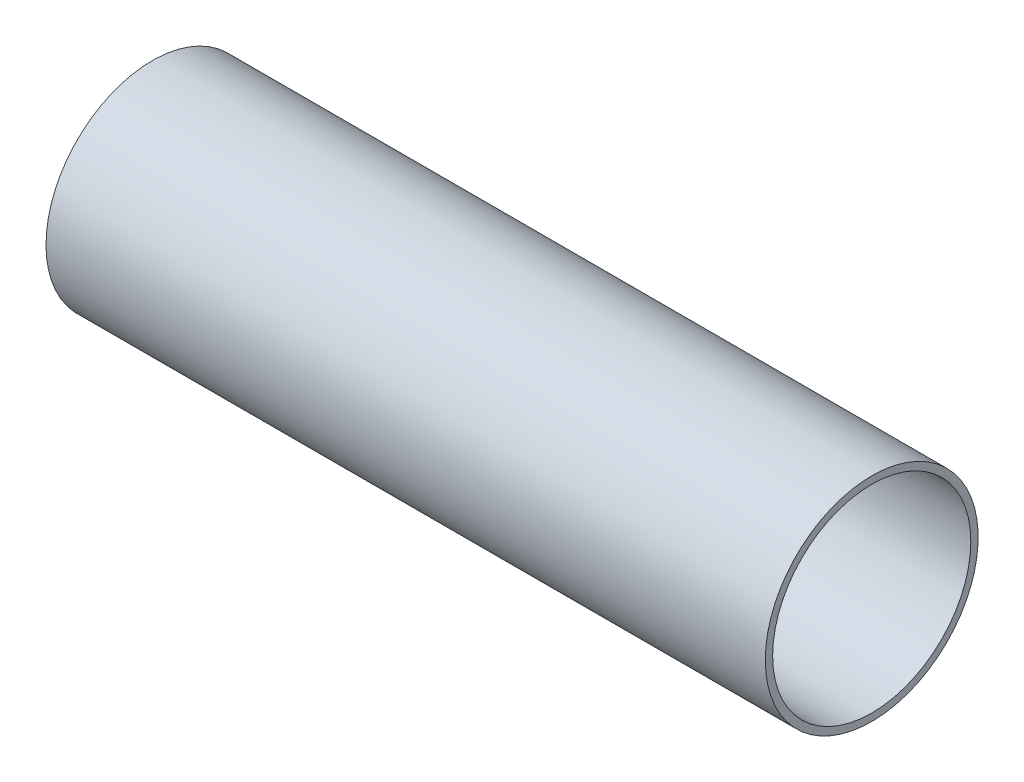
ISO-10303-21;
HEADER;
FILE_DESCRIPTION(('STEP AP214'),'2;1');
FILE_NAME('part.step','',(''),(''),'','','');
FILE_SCHEMA(('AUTOMOTIVE_DESIGN { 1 0 10303 214 1 1 1 1 }'));
ENDSEC;
DATA;
#1=APPLICATION_CONTEXT('core data for automotive mechanical design processes');
#2=APPLICATION_PROTOCOL_DEFINITION('international standard','automotive_design',2000,#1);
#3=PRODUCT_CONTEXT('',#1,'mechanical');
#4=PRODUCT('Part','Part','',(#3));
#5=PRODUCT_RELATED_PRODUCT_CATEGORY('part','',(#4));
#6=PRODUCT_DEFINITION_FORMATION('','',#4);
#7=PRODUCT_DEFINITION_CONTEXT('part definition',#1,'design');
#8=PRODUCT_DEFINITION('design','',#6,#7);
#9=PRODUCT_DEFINITION_SHAPE('','',#8);
#10=(LENGTH_UNIT() NAMED_UNIT(*) SI_UNIT(.MILLI.,.METRE.));
#11=(NAMED_UNIT(*) PLANE_ANGLE_UNIT() SI_UNIT($,.RADIAN.));
#12=(NAMED_UNIT(*) SI_UNIT($,.STERADIAN.) SOLID_ANGLE_UNIT());
#13=UNCERTAINTY_MEASURE_WITH_UNIT(LENGTH_MEASURE(1.E-05),#10,'distance_accuracy_value','');
#14=(GEOMETRIC_REPRESENTATION_CONTEXT(3) GLOBAL_UNCERTAINTY_ASSIGNED_CONTEXT((#13)) GLOBAL_UNIT_ASSIGNED_CONTEXT((#10,
#11,#12)) REPRESENTATION_CONTEXT('',''));
#15=CARTESIAN_POINT('',(0.,0.,0.));
#16=DIRECTION('',(0.,0.,1.));
#17=DIRECTION('',(1.,0.,0.));
#18=AXIS2_PLACEMENT_3D('',#15,#16,#17);
#19=CARTESIAN_POINT('',(0.,27.,0.));
#20=DIRECTION('',(1.,0.,0.));
#21=DIRECTION('',(0.,0.,-1.));
#22=AXIS2_PLACEMENT_3D('',#19,#20,#21);
#23=PLANE('',#22);
#24=CARTESIAN_POINT('',(0.,0.,0.));
#25=DIRECTION('',(-1.,0.,0.));
#26=DIRECTION('',(0.,0.,1.));
#27=AXIS2_PLACEMENT_3D('',#24,#25,#26);
#28=CIRCLE('',#27,27.);
#29=CARTESIAN_POINT('',(0.,0.,27.));
#30=VERTEX_POINT('',#29);
#31=EDGE_CURVE('E42',#30,#30,#28,.T.);
#32=ORIENTED_EDGE('',*,*,#31,.F.);
#33=EDGE_LOOP('',(#32));
#34=FACE_BOUND('',#33,.T.);
#35=CARTESIAN_POINT('',(0.,0.,0.));
#36=DIRECTION('',(-1.,0.,0.));
#37=DIRECTION('',(0.,0.,1.));
#38=AXIS2_PLACEMENT_3D('',#35,#36,#37);
#39=CIRCLE('',#38,29.);
#40=CARTESIAN_POINT('',(0.,0.,29.));
#41=VERTEX_POINT('',#40);
#42=EDGE_CURVE('E10',#41,#41,#39,.T.);
#43=ORIENTED_EDGE('',*,*,#42,.T.);
#44=EDGE_LOOP('',(#43));
#45=FACE_BOUND('',#44,.T.);
#46=ADVANCED_FACE('F28',(#34,#45),#23,.F.);
#47=CARTESIAN_POINT('',(-5.27343317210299,0.,0.));
#48=DIRECTION('',(-1.,0.,0.));
#49=DIRECTION('',(0.,0.,1.));
#50=AXIS2_PLACEMENT_3D('',#47,#48,#49);
#51=CYLINDRICAL_SURFACE('',#50,29.);
#52=CARTESIAN_POINT('',(196.,0.,0.));
#53=DIRECTION('',(-1.,0.,0.));
#54=DIRECTION('',(0.,0.,1.));
#55=AXIS2_PLACEMENT_3D('',#52,#53,#54);
#56=CIRCLE('',#55,29.);
#57=CARTESIAN_POINT('',(196.,0.,29.));
#58=VERTEX_POINT('',#57);
#59=EDGE_CURVE('E34',#58,#58,#56,.T.);
#60=CARTESIAN_POINT('',(0.,0.,29.));
#61=CARTESIAN_POINT('',(2.04166666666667,0.,29.));
#62=CARTESIAN_POINT('',(4.08333333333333,0.,29.));
#63=CARTESIAN_POINT('',(8.16666666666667,0.,29.));
#64=CARTESIAN_POINT('',(10.2083333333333,0.,29.));
#65=CARTESIAN_POINT('',(14.2916666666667,0.,29.));
#66=CARTESIAN_POINT('',(16.3333333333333,0.,29.));
#67=CARTESIAN_POINT('',(20.4166666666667,0.,29.));
#68=CARTESIAN_POINT('',(22.4583333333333,0.,29.));
#69=CARTESIAN_POINT('',(26.5416666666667,0.,29.));
#70=CARTESIAN_POINT('',(28.5833333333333,0.,29.));
#71=CARTESIAN_POINT('',(32.6666666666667,0.,29.));
#72=CARTESIAN_POINT('',(34.7083333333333,0.,29.));
#73=CARTESIAN_POINT('',(38.7916666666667,0.,29.));
#74=CARTESIAN_POINT('',(40.8333333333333,0.,29.));
#75=CARTESIAN_POINT('',(44.9166666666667,0.,29.));
#76=CARTESIAN_POINT('',(46.9583333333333,0.,29.));
#77=CARTESIAN_POINT('',(51.0416666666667,0.,29.));
#78=CARTESIAN_POINT('',(53.0833333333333,0.,29.));
#79=CARTESIAN_POINT('',(57.1666666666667,0.,29.));
#80=CARTESIAN_POINT('',(59.2083333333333,0.,29.));
#81=CARTESIAN_POINT('',(63.2916666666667,0.,29.));
#82=CARTESIAN_POINT('',(65.3333333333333,0.,29.));
#83=CARTESIAN_POINT('',(69.4166666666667,0.,29.));
#84=CARTESIAN_POINT('',(71.4583333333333,0.,29.));
#85=CARTESIAN_POINT('',(75.5416666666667,0.,29.));
#86=CARTESIAN_POINT('',(77.5833333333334,0.,29.));
#87=CARTESIAN_POINT('',(81.6666666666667,0.,29.));
#88=CARTESIAN_POINT('',(83.7083333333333,0.,29.));
#89=CARTESIAN_POINT('',(87.7916666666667,0.,29.));
#90=CARTESIAN_POINT('',(89.8333333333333,0.,29.));
#91=CARTESIAN_POINT('',(93.9166666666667,0.,29.));
#92=CARTESIAN_POINT('',(95.9583333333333,0.,29.));
#93=CARTESIAN_POINT('',(100.041666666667,0.,29.));
#94=CARTESIAN_POINT('',(102.083333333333,0.,29.));
#95=CARTESIAN_POINT('',(106.166666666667,0.,29.));
#96=CARTESIAN_POINT('',(108.208333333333,0.,29.));
#97=CARTESIAN_POINT('',(112.291666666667,0.,29.));
#98=CARTESIAN_POINT('',(114.333333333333,0.,29.));
#99=CARTESIAN_POINT('',(118.416666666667,0.,29.));
#100=CARTESIAN_POINT('',(120.458333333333,0.,29.));
#101=CARTESIAN_POINT('',(124.541666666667,0.,29.));
#102=CARTESIAN_POINT('',(126.583333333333,0.,29.));
#103=CARTESIAN_POINT('',(130.666666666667,0.,29.));
#104=CARTESIAN_POINT('',(132.708333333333,0.,29.));
#105=CARTESIAN_POINT('',(136.791666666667,0.,29.));
#106=CARTESIAN_POINT('',(138.833333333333,0.,29.));
#107=CARTESIAN_POINT('',(142.916666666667,0.,29.));
#108=CARTESIAN_POINT('',(144.958333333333,0.,29.));
#109=CARTESIAN_POINT('',(149.041666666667,0.,29.));
#110=CARTESIAN_POINT('',(151.083333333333,0.,29.));
#111=CARTESIAN_POINT('',(155.166666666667,0.,29.));
#112=CARTESIAN_POINT('',(157.208333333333,0.,29.));
#113=CARTESIAN_POINT('',(161.291666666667,0.,29.));
#114=CARTESIAN_POINT('',(163.333333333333,0.,29.));
#115=CARTESIAN_POINT('',(167.416666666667,0.,29.));
#116=CARTESIAN_POINT('',(169.458333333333,0.,29.));
#117=CARTESIAN_POINT('',(173.541666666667,0.,29.));
#118=CARTESIAN_POINT('',(175.583333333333,0.,29.));
#119=CARTESIAN_POINT('',(179.666666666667,0.,29.));
#120=CARTESIAN_POINT('',(181.708333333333,0.,29.));
#121=CARTESIAN_POINT('',(185.791666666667,0.,29.));
#122=CARTESIAN_POINT('',(187.833333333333,0.,29.));
#123=CARTESIAN_POINT('',(191.916666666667,0.,29.));
#124=CARTESIAN_POINT('',(193.958333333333,0.,29.));
#125=CARTESIAN_POINT('',(196.,0.,29.));
#126=B_SPLINE_CURVE_WITH_KNOTS('',3,(#60,#61,#62,#63,#64,#65,#66,#67,#68,#69,#70,#71,#72,#73,
#74,#75,#76,#77,#78,#79,#80,#81,#82,#83,#84,#85,#86,#87,#88,#89,#90,#91,#92,#93,#94,#95,#96,#97,
#98,#99,#100,#101,#102,#103,#104,#105,#106,#107,#108,#109,#110,#111,#112,#113,#114,#115,#116,
#117,#118,#119,#120,#121,#122,#123,#124,#125),.UNSPECIFIED.,.F.,.F.,(4,2,2,2,2,2,2,2,2,2,2,2,2,
2,2,2,2,2,2,2,2,2,2,2,2,2,2,2,2,2,2,2,4),(0.,6.125,12.25,18.375,24.5,30.625,36.75,42.875,49.,
55.125,61.25,67.375,73.5,79.625,85.75,91.875,98.,104.125,110.25,116.375,122.5,128.625,134.75,
140.875,147.,153.125,159.25,165.375,171.5,177.625,183.75,189.875,196.),.UNSPECIFIED.);
#127=EDGE_CURVE('BSEAM51',#41,#58,#126,.T.);
#128=ORIENTED_EDGE('',*,*,#42,.F.);
#129=ORIENTED_EDGE('',*,*,#59,.T.);
#130=ORIENTED_EDGE('',*,*,#127,.T.);
#131=ORIENTED_EDGE('',*,*,#127,.F.);
#132=EDGE_LOOP('',(#128,#130,#129,#131));
#133=FACE_BOUND('',#132,.T.);
#134=ADVANCED_FACE('F51',(#133),#51,.T.);
#135=CARTESIAN_POINT('',(196.,27.,0.));
#136=DIRECTION('',(-1.,0.,0.));
#137=DIRECTION('',(0.,0.,1.));
#138=AXIS2_PLACEMENT_3D('',#135,#136,#137);
#139=PLANE('',#138);
#140=ORIENTED_EDGE('',*,*,#59,.F.);
#141=EDGE_LOOP('',(#140));
#142=FACE_BOUND('',#141,.T.);
#143=CARTESIAN_POINT('',(196.,0.,0.));
#144=DIRECTION('',(-1.,0.,0.));
#145=DIRECTION('',(0.,0.,1.));
#146=AXIS2_PLACEMENT_3D('',#143,#144,#145);
#147=CIRCLE('',#146,27.);
#148=CARTESIAN_POINT('',(196.,0.,27.));
#149=VERTEX_POINT('',#148);
#150=EDGE_CURVE('E38',#149,#149,#147,.T.);
#151=ORIENTED_EDGE('',*,*,#150,.T.);
#152=EDGE_LOOP('',(#151));
#153=FACE_BOUND('',#152,.T.);
#154=ADVANCED_FACE('F55',(#142,#153),#139,.F.);
#155=CARTESIAN_POINT('',(-5.27343317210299,0.,0.));
#156=DIRECTION('',(-1.,0.,0.));
#157=DIRECTION('',(0.,0.,1.));
#158=AXIS2_PLACEMENT_3D('',#155,#156,#157);
#159=CYLINDRICAL_SURFACE('',#158,27.);
#160=CARTESIAN_POINT('',(196.,0.,27.));
#161=CARTESIAN_POINT('',(193.958333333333,0.,27.));
#162=CARTESIAN_POINT('',(191.916666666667,0.,27.));
#163=CARTESIAN_POINT('',(187.833333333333,0.,27.));
#164=CARTESIAN_POINT('',(185.791666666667,0.,27.));
#165=CARTESIAN_POINT('',(181.708333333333,0.,27.));
#166=CARTESIAN_POINT('',(179.666666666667,0.,27.));
#167=CARTESIAN_POINT('',(175.583333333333,0.,27.));
#168=CARTESIAN_POINT('',(173.541666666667,0.,27.));
#169=CARTESIAN_POINT('',(169.458333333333,0.,27.));
#170=CARTESIAN_POINT('',(167.416666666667,0.,27.));
#171=CARTESIAN_POINT('',(163.333333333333,0.,27.));
#172=CARTESIAN_POINT('',(161.291666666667,0.,27.));
#173=CARTESIAN_POINT('',(157.208333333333,0.,27.));
#174=CARTESIAN_POINT('',(155.166666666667,0.,27.));
#175=CARTESIAN_POINT('',(151.083333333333,0.,27.));
#176=CARTESIAN_POINT('',(149.041666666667,0.,27.));
#177=CARTESIAN_POINT('',(144.958333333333,0.,27.));
#178=CARTESIAN_POINT('',(142.916666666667,0.,27.));
#179=CARTESIAN_POINT('',(138.833333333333,0.,27.));
#180=CARTESIAN_POINT('',(136.791666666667,0.,27.));
#181=CARTESIAN_POINT('',(132.708333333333,0.,27.));
#182=CARTESIAN_POINT('',(130.666666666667,0.,27.));
#183=CARTESIAN_POINT('',(126.583333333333,0.,27.));
#184=CARTESIAN_POINT('',(124.541666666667,0.,27.));
#185=CARTESIAN_POINT('',(120.458333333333,0.,27.));
#186=CARTESIAN_POINT('',(118.416666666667,0.,27.));
#187=CARTESIAN_POINT('',(114.333333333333,0.,27.));
#188=CARTESIAN_POINT('',(112.291666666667,0.,27.));
#189=CARTESIAN_POINT('',(108.208333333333,0.,27.));
#190=CARTESIAN_POINT('',(106.166666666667,0.,27.));
#191=CARTESIAN_POINT('',(102.083333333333,0.,27.));
#192=CARTESIAN_POINT('',(100.041666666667,0.,27.));
#193=CARTESIAN_POINT('',(95.9583333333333,0.,27.));
#194=CARTESIAN_POINT('',(93.9166666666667,0.,27.));
#195=CARTESIAN_POINT('',(89.8333333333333,0.,27.));
#196=CARTESIAN_POINT('',(87.7916666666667,0.,27.));
#197=CARTESIAN_POINT('',(83.7083333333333,0.,27.));
#198=CARTESIAN_POINT('',(81.6666666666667,0.,27.));
#199=CARTESIAN_POINT('',(77.5833333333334,0.,27.));
#200=CARTESIAN_POINT('',(75.5416666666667,0.,27.));
#201=CARTESIAN_POINT('',(71.4583333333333,0.,27.));
#202=CARTESIAN_POINT('',(69.4166666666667,0.,27.));
#203=CARTESIAN_POINT('',(65.3333333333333,0.,27.));
#204=CARTESIAN_POINT('',(63.2916666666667,0.,27.));
#205=CARTESIAN_POINT('',(59.2083333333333,0.,27.));
#206=CARTESIAN_POINT('',(57.1666666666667,0.,27.));
#207=CARTESIAN_POINT('',(53.0833333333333,0.,27.));
#208=CARTESIAN_POINT('',(51.0416666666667,0.,27.));
#209=CARTESIAN_POINT('',(46.9583333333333,0.,27.));
#210=CARTESIAN_POINT('',(44.9166666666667,0.,27.));
#211=CARTESIAN_POINT('',(40.8333333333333,0.,27.));
#212=CARTESIAN_POINT('',(38.7916666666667,0.,27.));
#213=CARTESIAN_POINT('',(34.7083333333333,0.,27.));
#214=CARTESIAN_POINT('',(32.6666666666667,0.,27.));
#215=CARTESIAN_POINT('',(28.5833333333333,0.,27.));
#216=CARTESIAN_POINT('',(26.5416666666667,0.,27.));
#217=CARTESIAN_POINT('',(22.4583333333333,0.,27.));
#218=CARTESIAN_POINT('',(20.4166666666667,0.,27.));
#219=CARTESIAN_POINT('',(16.3333333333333,0.,27.));
#220=CARTESIAN_POINT('',(14.2916666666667,0.,27.));
#221=CARTESIAN_POINT('',(10.2083333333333,0.,27.));
#222=CARTESIAN_POINT('',(8.16666666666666,0.,27.));
#223=CARTESIAN_POINT('',(4.08333333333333,0.,27.));
#224=CARTESIAN_POINT('',(2.04166666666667,0.,27.));
#225=CARTESIAN_POINT('',(0.,0.,27.));
#226=B_SPLINE_CURVE_WITH_KNOTS('',3,(#160,#161,#162,#163,#164,#165,#166,#167,#168,#169,#170,
#171,#172,#173,#174,#175,#176,#177,#178,#179,#180,#181,#182,#183,#184,#185,#186,#187,#188,#189,
#190,#191,#192,#193,#194,#195,#196,#197,#198,#199,#200,#201,#202,#203,#204,#205,#206,#207,#208,
#209,#210,#211,#212,#213,#214,#215,#216,#217,#218,#219,#220,#221,#222,#223,#224,#225),
.UNSPECIFIED.,.F.,.F.,(4,2,2,2,2,2,2,2,2,2,2,2,2,2,2,2,2,2,2,2,2,2,2,2,2,2,2,2,2,2,2,2,4),(0.,
6.12499999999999,12.25,18.375,24.5,30.625,36.75,42.875,49.,55.125,61.25,67.375,73.5,79.625,
85.75,91.875,98.,104.125,110.25,116.375,122.5,128.625,134.75,140.875,147.,153.125,159.25,
165.375,171.5,177.625,183.75,189.875,196.),.UNSPECIFIED.);
#227=EDGE_CURVE('BSEAM48',#149,#30,#226,.T.);
#228=ORIENTED_EDGE('',*,*,#150,.F.);
#229=ORIENTED_EDGE('',*,*,#31,.T.);
#230=ORIENTED_EDGE('',*,*,#227,.T.);
#231=ORIENTED_EDGE('',*,*,#227,.F.);
#232=EDGE_LOOP('',(#228,#230,#229,#231));
#233=FACE_BOUND('',#232,.T.);
#234=ADVANCED_FACE('F48',(#233),#159,.F.);
#235=CLOSED_SHELL('',(#46,#134,#154,#234));
#236=MANIFOLD_SOLID_BREP('B2',#235);
#237=ADVANCED_BREP_SHAPE_REPRESENTATION('',(#18,#236),#14);
#238=SHAPE_DEFINITION_REPRESENTATION(#9,#237);
ENDSEC;
END-ISO-10303-21;
